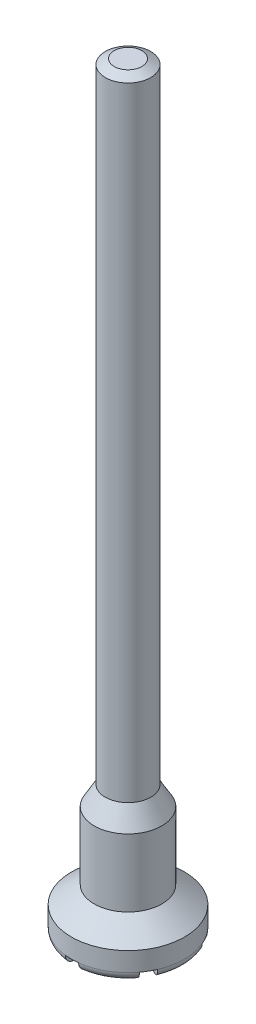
ISO-10303-21;
HEADER;
FILE_DESCRIPTION(('STEP AP214'),'2;1');
FILE_NAME('part.step','',(''),(''),'','','');
FILE_SCHEMA(('AUTOMOTIVE_DESIGN { 1 0 10303 214 1 1 1 1 }'));
ENDSEC;
DATA;
#1=APPLICATION_CONTEXT('core data for automotive mechanical design processes');
#2=APPLICATION_PROTOCOL_DEFINITION('international standard','automotive_design',2000,#1);
#3=PRODUCT_CONTEXT('',#1,'mechanical');
#4=PRODUCT('Part','Part','',(#3));
#5=PRODUCT_RELATED_PRODUCT_CATEGORY('part','',(#4));
#6=PRODUCT_DEFINITION_FORMATION('','',#4);
#7=PRODUCT_DEFINITION_CONTEXT('part definition',#1,'design');
#8=PRODUCT_DEFINITION('design','',#6,#7);
#9=PRODUCT_DEFINITION_SHAPE('','',#8);
#10=(LENGTH_UNIT() NAMED_UNIT(*) SI_UNIT(.MILLI.,.METRE.));
#11=(NAMED_UNIT(*) PLANE_ANGLE_UNIT() SI_UNIT($,.RADIAN.));
#12=(NAMED_UNIT(*) SI_UNIT($,.STERADIAN.) SOLID_ANGLE_UNIT());
#13=UNCERTAINTY_MEASURE_WITH_UNIT(LENGTH_MEASURE(1.E-05),#10,'distance_accuracy_value','');
#14=(GEOMETRIC_REPRESENTATION_CONTEXT(3) GLOBAL_UNCERTAINTY_ASSIGNED_CONTEXT((#13)) GLOBAL_UNIT_ASSIGNED_CONTEXT((#10,
#11,#12)) REPRESENTATION_CONTEXT('',''));
#15=CARTESIAN_POINT('',(0.,0.,0.));
#16=DIRECTION('',(0.,0.,1.));
#17=DIRECTION('',(1.,0.,0.));
#18=AXIS2_PLACEMENT_3D('',#15,#16,#17);
#19=CARTESIAN_POINT('',(0.,0.,0.));
#20=DIRECTION('',(0.,-1.,0.));
#21=DIRECTION('',(0.,0.,-1.));
#22=AXIS2_PLACEMENT_3D('',#19,#20,#21);
#23=PLANE('',#22);
#24=CARTESIAN_POINT('',(0.,0.,0.));
#25=DIRECTION('',(0.,1.,0.));
#26=DIRECTION('',(-0.140186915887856,0.,-0.99012505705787));
#27=AXIS2_PLACEMENT_3D('',#24,#25,#26);
#28=CIRCLE('',#27,1.07);
#29=CARTESIAN_POINT('',(-0.150000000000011,0.,-1.05943381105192));
#30=VERTEX_POINT('',#29);
#31=CARTESIAN_POINT('',(-0.842496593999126,0.,-0.659620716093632));
#32=VERTEX_POINT('',#31);
#33=EDGE_CURVE('E651',#30,#32,#28,.T.);
#34=ORIENTED_EDGE('',*,*,#33,.F.);
#35=DIRECTION('',(0.,0.,1.));
#36=VECTOR('',#35,1.);
#37=CARTESIAN_POINT('',(-0.150000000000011,0.,1.37215571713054));
#38=LINE('',#37,#36);
#39=CARTESIAN_POINT('',(-0.150000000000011,0.,-0.259807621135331));
#40=VERTEX_POINT('',#39);
#41=EDGE_CURVE('E653',#30,#40,#38,.T.);
#42=ORIENTED_EDGE('',*,*,#41,.T.);
#43=DIRECTION('',(-0.866025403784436,0.,-0.5));
#44=VECTOR('',#43,1.);
#45=CARTESIAN_POINT('',(-1.11332170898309,0.,-0.81598166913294));
#46=LINE('',#45,#44);
#47=EDGE_CURVE('E655',#40,#32,#46,.T.);
#48=ORIENTED_EDGE('',*,*,#47,.T.);
#49=EDGE_LOOP('',(#34,#42,#48));
#50=FACE_BOUND('',#49,.T.);
#51=ADVANCED_FACE('F16',(#50),#23,.T.);
#52=CARTESIAN_POINT('',(0.,0.,0.));
#53=DIRECTION('',(0.,-1.,0.));
#54=DIRECTION('',(0.,0.,-1.));
#55=AXIS2_PLACEMENT_3D('',#52,#53,#54);
#56=PLANE('',#55);
#57=DIRECTION('',(-0.866025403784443,0.,0.499999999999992));
#58=VECTOR('',#57,1.);
#59=CARTESIAN_POINT('',(1.11332170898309,0.,-0.815981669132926));
#60=LINE('',#59,#58);
#61=CARTESIAN_POINT('',(-0.299999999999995,0.,0.));
#62=VERTEX_POINT('',#61);
#63=CARTESIAN_POINT('',(-0.992496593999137,0.,0.399813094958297));
#64=VERTEX_POINT('',#63);
#65=EDGE_CURVE('E770',#62,#64,#60,.T.);
#66=ORIENTED_EDGE('',*,*,#65,.T.);
#67=CARTESIAN_POINT('',(0.,0.,0.));
#68=DIRECTION('',(0.,1.,0.));
#69=DIRECTION('',(-0.927566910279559,0.,-0.373657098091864));
#70=AXIS2_PLACEMENT_3D('',#67,#68,#69);
#71=CIRCLE('',#70,1.07);
#72=CARTESIAN_POINT('',(-0.992496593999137,0.,-0.399813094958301));
#73=VERTEX_POINT('',#72);
#74=EDGE_CURVE('E681',#73,#64,#71,.T.);
#75=ORIENTED_EDGE('',*,*,#74,.F.);
#76=DIRECTION('',(0.866025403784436,0.,0.5));
#77=VECTOR('',#76,1.);
#78=CARTESIAN_POINT('',(-1.26332170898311,0.,-0.556174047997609));
#79=LINE('',#78,#77);
#80=EDGE_CURVE('E768',#73,#62,#79,.T.);
#81=ORIENTED_EDGE('',*,*,#80,.T.);
#82=EDGE_LOOP('',(#66,#75,#81));
#83=FACE_BOUND('',#82,.T.);
#84=ADVANCED_FACE('F632',(#83),#56,.T.);
#85=CARTESIAN_POINT('',(0.,0.,0.));
#86=DIRECTION('',(0.,-1.,0.));
#87=DIRECTION('',(0.,0.,-1.));
#88=AXIS2_PLACEMENT_3D('',#85,#86,#87);
#89=PLANE('',#88);
#90=DIRECTION('',(0.,0.,1.));
#91=VECTOR('',#90,1.);
#92=CARTESIAN_POINT('',(-0.150000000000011,0.,1.37215571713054));
#93=LINE('',#92,#91);
#94=CARTESIAN_POINT('',(-0.150000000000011,0.,0.259807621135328));
#95=VERTEX_POINT('',#94);
#96=CARTESIAN_POINT('',(-0.149999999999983,0.,1.05943381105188));
#97=VERTEX_POINT('',#96);
#98=EDGE_CURVE('E155',#95,#97,#93,.T.);
#99=ORIENTED_EDGE('',*,*,#98,.T.);
#100=CARTESIAN_POINT('',(0.,0.,0.));
#101=DIRECTION('',(0.,1.,0.));
#102=DIRECTION('',(-0.787379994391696,0.,0.616467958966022));
#103=AXIS2_PLACEMENT_3D('',#100,#101,#102);
#104=CIRCLE('',#103,1.06999999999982);
#105=CARTESIAN_POINT('',(-0.842496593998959,0.,0.659620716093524));
#106=VERTEX_POINT('',#105);
#107=EDGE_CURVE('E159',#106,#97,#104,.T.);
#108=ORIENTED_EDGE('',*,*,#107,.F.);
#109=DIRECTION('',(0.866025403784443,0.,-0.499999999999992));
#110=VECTOR('',#109,1.);
#111=CARTESIAN_POINT('',(1.26332170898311,0.,-0.556174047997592));
#112=LINE('',#111,#110);
#113=EDGE_CURVE('E162',#106,#95,#112,.T.);
#114=ORIENTED_EDGE('',*,*,#113,.T.);
#115=EDGE_LOOP('',(#99,#108,#114));
#116=FACE_BOUND('',#115,.T.);
#117=ADVANCED_FACE('F157',(#116),#89,.T.);
#118=CARTESIAN_POINT('',(0.,0.,0.));
#119=DIRECTION('',(0.,-1.,0.));
#120=DIRECTION('',(0.,0.,-1.));
#121=AXIS2_PLACEMENT_3D('',#118,#119,#120);
#122=PLANE('',#121);
#123=CARTESIAN_POINT('',(0.,0.,0.));
#124=DIRECTION('',(0.,1.,0.));
#125=DIRECTION('',(0.140186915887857,0.,0.99012505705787));
#126=AXIS2_PLACEMENT_3D('',#123,#124,#125);
#127=CIRCLE('',#126,1.07);
#128=CARTESIAN_POINT('',(0.150000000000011,0.,1.05943381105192));
#129=VERTEX_POINT('',#128);
#130=CARTESIAN_POINT('',(0.842496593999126,0.,0.659620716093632));
#131=VERTEX_POINT('',#130);
#132=EDGE_CURVE('E331',#129,#131,#127,.T.);
#133=ORIENTED_EDGE('',*,*,#132,.F.);
#134=DIRECTION('',(0.,0.,-1.));
#135=VECTOR('',#134,1.);
#136=CARTESIAN_POINT('',(0.150000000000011,0.,1.37215571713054));
#137=LINE('',#136,#135);
#138=CARTESIAN_POINT('',(0.150000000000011,0.,0.259807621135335));
#139=VERTEX_POINT('',#138);
#140=EDGE_CURVE('E222',#129,#139,#137,.T.);
#141=ORIENTED_EDGE('',*,*,#140,.T.);
#142=DIRECTION('',(0.866025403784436,0.,0.5));
#143=VECTOR('',#142,1.);
#144=CARTESIAN_POINT('',(-1.26332170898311,0.,-0.556174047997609));
#145=LINE('',#144,#143);
#146=EDGE_CURVE('E837',#139,#131,#145,.T.);
#147=ORIENTED_EDGE('',*,*,#146,.T.);
#148=EDGE_LOOP('',(#133,#141,#147));
#149=FACE_BOUND('',#148,.T.);
#150=ADVANCED_FACE('F617',(#149),#122,.T.);
#151=CARTESIAN_POINT('',(0.,0.,0.));
#152=DIRECTION('',(0.,-1.,0.));
#153=DIRECTION('',(0.,0.,-1.));
#154=AXIS2_PLACEMENT_3D('',#151,#152,#153);
#155=PLANE('',#154);
#156=DIRECTION('',(0.866025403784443,0.,-0.499999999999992));
#157=VECTOR('',#156,1.);
#158=CARTESIAN_POINT('',(1.26332170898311,0.,-0.556174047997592));
#159=LINE('',#158,#157);
#160=CARTESIAN_POINT('',(0.299999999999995,0.,0.));
#161=VERTEX_POINT('',#160);
#162=CARTESIAN_POINT('',(0.992496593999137,0.,-0.399813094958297));
#163=VERTEX_POINT('',#162);
#164=EDGE_CURVE('E849',#161,#163,#159,.T.);
#165=ORIENTED_EDGE('',*,*,#164,.T.);
#166=CARTESIAN_POINT('',(0.,0.,0.));
#167=DIRECTION('',(0.,1.,0.));
#168=DIRECTION('',(0.927566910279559,0.,0.373657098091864));
#169=AXIS2_PLACEMENT_3D('',#166,#167,#168);
#170=CIRCLE('',#169,1.07);
#171=CARTESIAN_POINT('',(0.992496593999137,0.,0.399813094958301));
#172=VERTEX_POINT('',#171);
#173=EDGE_CURVE('E718',#172,#163,#170,.T.);
#174=ORIENTED_EDGE('',*,*,#173,.F.);
#175=DIRECTION('',(-0.866025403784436,0.,-0.5));
#176=VECTOR('',#175,1.);
#177=CARTESIAN_POINT('',(-1.11332170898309,0.,-0.81598166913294));
#178=LINE('',#177,#176);
#179=EDGE_CURVE('E841',#172,#161,#178,.T.);
#180=ORIENTED_EDGE('',*,*,#179,.T.);
#181=EDGE_LOOP('',(#165,#174,#180));
#182=FACE_BOUND('',#181,.T.);
#183=ADVANCED_FACE('F609',(#182),#155,.T.);
#184=CARTESIAN_POINT('',(0.,0.,0.));
#185=DIRECTION('',(0.,-1.,0.));
#186=DIRECTION('',(0.,0.,-1.));
#187=AXIS2_PLACEMENT_3D('',#184,#185,#186);
#188=PLANE('',#187);
#189=DIRECTION('',(0.,0.,-1.));
#190=VECTOR('',#189,1.);
#191=CARTESIAN_POINT('',(0.150000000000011,0.,1.37215571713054));
#192=LINE('',#191,#190);
#193=CARTESIAN_POINT('',(0.150000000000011,0.,-0.259807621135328));
#194=VERTEX_POINT('',#193);
#195=CARTESIAN_POINT('',(0.149999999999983,0.,-1.05943381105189));
#196=VERTEX_POINT('',#195);
#197=EDGE_CURVE('E780',#194,#196,#192,.T.);
#198=ORIENTED_EDGE('',*,*,#197,.T.);
#199=CARTESIAN_POINT('',(0.,0.,0.));
#200=DIRECTION('',(0.,1.,0.));
#201=DIRECTION('',(0.787379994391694,0.,-0.616467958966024));
#202=AXIS2_PLACEMENT_3D('',#199,#200,#201);
#203=CIRCLE('',#202,1.06999999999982);
#204=CARTESIAN_POINT('',(0.842496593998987,0.,-0.659620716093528));
#205=VERTEX_POINT('',#204);
#206=EDGE_CURVE('E283',#205,#196,#203,.T.);
#207=ORIENTED_EDGE('',*,*,#206,.F.);
#208=DIRECTION('',(-0.866025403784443,0.,0.499999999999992));
#209=VECTOR('',#208,1.);
#210=CARTESIAN_POINT('',(1.11332170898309,0.,-0.815981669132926));
#211=LINE('',#210,#209);
#212=EDGE_CURVE('E782',#205,#194,#211,.T.);
#213=ORIENTED_EDGE('',*,*,#212,.T.);
#214=EDGE_LOOP('',(#198,#207,#213));
#215=FACE_BOUND('',#214,.T.);
#216=ADVANCED_FACE('F602',(#215),#188,.T.);
#217=CARTESIAN_POINT('',(-0.150000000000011,0.199999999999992,1.37215571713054));
#218=DIRECTION('',(-1.,0.,0.));
#219=DIRECTION('',(0.,0.,1.));
#220=AXIS2_PLACEMENT_3D('',#217,#218,#219);
#221=PLANE('',#220);
#222=DIRECTION('',(0.,1.,0.));
#223=VECTOR('',#222,1.);
#224=CARTESIAN_POINT('',(-0.150000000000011,0.200000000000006,0.259807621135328));
#225=LINE('',#224,#223);
#226=CARTESIAN_POINT('',(-0.150000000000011,0.200000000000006,0.259807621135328));
#227=VERTEX_POINT('',#226);
#228=EDGE_CURVE('E772',#95,#227,#225,.T.);
#229=ORIENTED_EDGE('',*,*,#228,.T.);
#230=DIRECTION('',(0.,0.,-1.));
#231=VECTOR('',#230,1.);
#232=CARTESIAN_POINT('',(-0.150000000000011,0.200000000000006,-1.44179222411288));
#233=LINE('',#232,#231);
#234=CARTESIAN_POINT('',(-0.150000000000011,0.199999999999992,1.26111062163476));
#235=VERTEX_POINT('',#234);
#236=EDGE_CURVE('E170',#235,#227,#233,.T.);
#237=ORIENTED_EDGE('',*,*,#236,.F.);
#238=CARTESIAN_POINT('',(-0.150000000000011,0.,1.05943381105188));
#239=CARTESIAN_POINT('',(-0.150000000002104,-9.38730632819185E-06,1.0708558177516));
#240=CARTESIAN_POINT('',(-0.150000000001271,0.000958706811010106,1.08227611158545));
#241=CARTESIAN_POINT('',(-0.14999999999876,0.00478560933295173,1.10479022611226));
#242=CARTESIAN_POINT('',(-0.149999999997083,0.00764354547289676,1.1158841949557));
#243=CARTESIAN_POINT('',(-0.149999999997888,0.0151884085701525,1.13744063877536));
#244=CARTESIAN_POINT('',(-0.150000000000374,0.019876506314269,1.14790270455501));
#245=CARTESIAN_POINT('',(-0.149999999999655,0.0309504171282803,1.1678825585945));
#246=CARTESIAN_POINT('',(-0.149999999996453,0.037335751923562,1.17740061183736));
#247=CARTESIAN_POINT('',(-0.149999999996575,0.0515895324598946,1.1951686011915));
#248=CARTESIAN_POINT('',(-0.149999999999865,0.0594498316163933,1.2034250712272));
#249=CARTESIAN_POINT('',(-0.150000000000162,0.076454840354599,1.2184877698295));
#250=CARTESIAN_POINT('',(-0.149999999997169,0.085599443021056,1.22529411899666));
#251=CARTESIAN_POINT('',(-0.149999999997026,0.104836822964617,1.23720872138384));
#252=CARTESIAN_POINT('',(-0.149999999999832,0.114921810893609,1.24232956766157));
#253=CARTESIAN_POINT('',(-0.150000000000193,0.135809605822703,1.25079058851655));
#254=CARTESIAN_POINT('',(-0.149999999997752,0.146611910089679,1.25413199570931));
#255=CARTESIAN_POINT('',(-0.149999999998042,0.164573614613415,1.25805581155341));
#256=CARTESIAN_POINT('',(-0.149999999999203,0.171615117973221,1.25920071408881));
#257=CARTESIAN_POINT('',(-0.150000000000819,0.18577004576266,1.26072795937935));
#258=CARTESIAN_POINT('',(-0.150000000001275,0.192883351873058,1.26111139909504));
#259=CARTESIAN_POINT('',(-0.149999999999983,0.199999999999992,1.26111062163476));
#260=B_SPLINE_CURVE_WITH_KNOTS('',3,(#238,#239,#240,#241,#242,#243,#244,#245,#246,#247,#248,
#249,#250,#251,#252,#253,#254,#255,#256,#257,#258,#259),.UNSPECIFIED.,.F.,.F.,(4,2,2,2,2,2,2,2,
2,2,4),(0.,0.0342227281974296,0.0684296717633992,0.10265853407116,0.1368777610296,
0.170913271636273,0.204945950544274,0.238718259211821,0.272467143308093,0.293831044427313,
0.315164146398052),.UNSPECIFIED.);
#261=EDGE_CURVE('E167',#97,#235,#260,.T.);
#262=ORIENTED_EDGE('',*,*,#261,.F.);
#263=ORIENTED_EDGE('',*,*,#98,.F.);
#264=EDGE_LOOP('',(#229,#237,#262,#263));
#265=FACE_BOUND('',#264,.T.);
#266=ADVANCED_FACE('F168',(#265),#221,.F.);
#267=CARTESIAN_POINT('',(1.26332170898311,0.200000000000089,-0.556174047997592));
#268=DIRECTION('',(0.499999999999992,0.,0.866025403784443));
#269=DIRECTION('',(0.866025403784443,0.,-0.499999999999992));
#270=AXIS2_PLACEMENT_3D('',#267,#268,#269);
#271=PLANE('',#270);
#272=DIRECTION('',(-0.866025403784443,0.,0.499999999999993));
#273=VECTOR('',#272,1.);
#274=CARTESIAN_POINT('',(-0.150000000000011,0.200000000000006,0.259807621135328));
#275=LINE('',#274,#273);
#276=CARTESIAN_POINT('',(-1.01715383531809,0.200000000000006,0.760459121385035));
#277=VERTEX_POINT('',#276);
#278=EDGE_CURVE('E369',#227,#277,#275,.T.);
#279=ORIENTED_EDGE('',*,*,#278,.F.);
#280=ORIENTED_EDGE('',*,*,#228,.F.);
#281=ORIENTED_EDGE('',*,*,#113,.F.);
#282=CARTESIAN_POINT('',(-1.01715383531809,0.200000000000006,0.760459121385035));
#283=CARTESIAN_POINT('',(-1.01716235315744,0.188808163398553,0.760464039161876));
#284=CARTESIAN_POINT('',(-1.01633505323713,0.177619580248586,0.759986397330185));
#285=CARTESIAN_POINT('',(-1.01307207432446,0.155570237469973,0.758102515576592));
#286=CARTESIAN_POINT('',(-1.01063794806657,0.14470917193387,0.756697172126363));
#287=CARTESIAN_POINT('',(-1.00422299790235,0.123608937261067,0.752993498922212));
#288=CARTESIAN_POINT('',(-1.00024152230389,0.113370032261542,0.750694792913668));
#289=CARTESIAN_POINT('',(-0.990851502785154,0.0938077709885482,0.745273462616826));
#290=CARTESIAN_POINT('',(-0.985443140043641,0.0844842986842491,0.742150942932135));
#291=CARTESIAN_POINT('',(-0.973337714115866,0.0669857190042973,0.735161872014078));
#292=CARTESIAN_POINT('',(-0.966637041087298,0.058813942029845,0.731293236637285));
#293=CARTESIAN_POINT('',(-0.952149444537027,0.0438746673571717,0.722928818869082));
#294=CARTESIAN_POINT('',(-0.944362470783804,0.037107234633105,0.718433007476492));
#295=CARTESIAN_POINT('',(-0.927866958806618,0.0251179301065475,0.708909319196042));
#296=CARTESIAN_POINT('',(-0.919152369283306,0.0199071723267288,0.703877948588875));
#297=CARTESIAN_POINT('',(-0.901094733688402,0.0112357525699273,0.693452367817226));
#298=CARTESIAN_POINT('',(-0.891751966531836,0.00777431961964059,0.688058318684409));
#299=CARTESIAN_POINT('',(-0.875716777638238,0.00349249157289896,0.678800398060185));
#300=CARTESIAN_POINT('',(-0.869118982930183,0.0021832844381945,0.67499115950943));
#301=CARTESIAN_POINT('',(-0.855847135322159,0.000437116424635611,0.667328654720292));
#302=CARTESIAN_POINT('',(-0.849173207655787,-1.11362262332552E-06,0.66347546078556));
#303=CARTESIAN_POINT('',(-0.842496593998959,0.,0.659620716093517));
#304=B_SPLINE_CURVE_WITH_KNOTS('',3,(#282,#283,#284,#285,#286,#287,#288,#289,#290,#291,#292,
#293,#294,#295,#296,#297,#298,#299,#300,#301,#302,#303),.UNSPECIFIED.,.F.,.F.,(4,2,2,2,2,2,2,2,
2,2,4),(0.,0.0335300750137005,0.0670277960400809,0.10053964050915,0.134047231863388,
0.167649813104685,0.201253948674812,0.23509256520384,0.268916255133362,0.292059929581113,
0.315169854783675),.UNSPECIFIED.);
#305=EDGE_CURVE('E178',#277,#106,#304,.T.);
#306=ORIENTED_EDGE('',*,*,#305,.F.);
#307=EDGE_LOOP('',(#279,#280,#281,#306));
#308=FACE_BOUND('',#307,.T.);
#309=ADVANCED_FACE('F587',(#308),#271,.F.);
#310=CARTESIAN_POINT('',(1.11332170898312,0.200000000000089,-0.815981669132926));
#311=DIRECTION('',(-0.499999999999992,0.,-0.866025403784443));
#312=DIRECTION('',(-0.866025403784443,0.,0.499999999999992));
#313=AXIS2_PLACEMENT_3D('',#310,#311,#312);
#314=PLANE('',#313);
#315=ORIENTED_EDGE('',*,*,#65,.F.);
#316=DIRECTION('',(0.,1.,0.));
#317=VECTOR('',#316,1.);
#318=CARTESIAN_POINT('',(-0.299999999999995,0.200000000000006,0.));
#319=LINE('',#318,#317);
#320=CARTESIAN_POINT('',(-0.299999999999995,0.200000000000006,0.));
#321=VERTEX_POINT('',#320);
#322=EDGE_CURVE('E774',#62,#321,#319,.T.);
#323=ORIENTED_EDGE('',*,*,#322,.T.);
#324=DIRECTION('',(0.866025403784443,0.,-0.499999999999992));
#325=VECTOR('',#324,1.);
#326=CARTESIAN_POINT('',(-1.1671538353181,0.200000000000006,0.500651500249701));
#327=LINE('',#326,#325);
#328=CARTESIAN_POINT('',(-1.1671538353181,0.200000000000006,0.500651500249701));
#329=VERTEX_POINT('',#328);
#330=EDGE_CURVE('E374',#329,#321,#327,.T.);
#331=ORIENTED_EDGE('',*,*,#330,.F.);
#332=CARTESIAN_POINT('',(-0.992496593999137,0.,0.399813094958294));
#333=CARTESIAN_POINT('',(-1.00238834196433,-9.38730634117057E-06,0.405524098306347));
#334=CARTESIAN_POINT('',(-1.01227860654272,0.0009587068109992,0.411234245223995));
#335=CARTESIAN_POINT('',(-1.03177640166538,0.00478560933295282,0.422491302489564));
#336=CARTESIAN_POINT('',(-1.04138406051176,0.00764354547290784,0.428038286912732));
#337=CARTESIAN_POINT('',(-1.06005248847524,0.0151884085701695,0.438816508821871));
#338=CARTESIAN_POINT('',(-1.06911290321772,0.0198765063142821,0.444047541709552));
#339=CARTESIAN_POINT('',(-1.08641596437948,0.0309504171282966,0.454037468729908));
#340=CARTESIAN_POINT('',(-1.09465884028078,0.0373357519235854,0.45879649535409));
#341=CARTESIAN_POINT('',(-1.11004637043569,0.0515895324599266,0.467680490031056));
#342=CARTESIAN_POINT('',(-1.11719668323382,0.0594498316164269,0.47180872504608));
#343=CARTESIAN_POINT('',(-1.13024136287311,0.0764548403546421,0.479340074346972));
#344=CARTESIAN_POINT('',(-1.13613583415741,0.0855994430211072,0.48274324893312));
#345=CARTESIAN_POINT('',(-1.14645418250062,0.104836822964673,0.488700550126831));
#346=CARTESIAN_POINT('',(-1.1508889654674,0.114921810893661,0.491260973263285));
#347=CARTESIAN_POINT('',(-1.15821642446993,0.135809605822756,0.495491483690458));
#348=CARTESIAN_POINT('',(-1.16111016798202,0.146611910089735,0.49716218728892));
#349=CARTESIAN_POINT('',(-1.16450829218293,0.164573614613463,0.499124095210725));
#350=CARTESIAN_POINT('',(-1.16549980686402,0.171615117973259,0.499696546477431));
#351=CARTESIAN_POINT('',(-1.16682244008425,0.185770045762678,0.500460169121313));
#352=CARTESIAN_POINT('',(-1.16715450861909,0.192883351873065,0.500651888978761));
#353=CARTESIAN_POINT('',(-1.1671538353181,0.199999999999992,0.500651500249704));
#354=B_SPLINE_CURVE_WITH_KNOTS('',3,(#332,#333,#334,#335,#336,#337,#338,#339,#340,#341,#342,
#343,#344,#345,#346,#347,#348,#349,#350,#351,#352,#353),.UNSPECIFIED.,.F.,.F.,(4,2,2,2,2,2,2,2,
2,2,4),(0.,0.0342227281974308,0.0684296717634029,0.102658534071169,0.136877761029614,
0.170913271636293,0.204945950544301,0.238718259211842,0.272467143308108,0.293831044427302,
0.315164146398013),.UNSPECIFIED.);
#355=EDGE_CURVE('E678',#64,#329,#354,.T.);
#356=ORIENTED_EDGE('',*,*,#355,.F.);
#357=EDGE_LOOP('',(#315,#323,#331,#356));
#358=FACE_BOUND('',#357,.T.);
#359=ADVANCED_FACE('F579',(#358),#314,.F.);
#360=CARTESIAN_POINT('',(-1.26332170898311,0.200000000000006,-0.556174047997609));
#361=DIRECTION('',(-0.500000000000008,0.,0.866025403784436));
#362=DIRECTION('',(0.866025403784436,0.,0.5));
#363=AXIS2_PLACEMENT_3D('',#360,#361,#362);
#364=PLANE('',#363);
#365=DIRECTION('',(-0.866025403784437,0.,-0.5));
#366=VECTOR('',#365,1.);
#367=CARTESIAN_POINT('',(-0.299999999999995,0.200000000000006,0.));
#368=LINE('',#367,#366);
#369=CARTESIAN_POINT('',(-1.16715383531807,0.200000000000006,-0.500651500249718));
#370=VERTEX_POINT('',#369);
#371=EDGE_CURVE('E379',#321,#370,#368,.T.);
#372=ORIENTED_EDGE('',*,*,#371,.F.);
#373=ORIENTED_EDGE('',*,*,#322,.F.);
#374=ORIENTED_EDGE('',*,*,#80,.F.);
#375=CARTESIAN_POINT('',(-1.16715383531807,0.200000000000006,-0.500651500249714));
#376=CARTESIAN_POINT('',(-1.16716235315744,0.18880816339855,-0.500656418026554));
#377=CARTESIAN_POINT('',(-1.16633505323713,0.177619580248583,-0.500178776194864));
#378=CARTESIAN_POINT('',(-1.16307207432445,0.155570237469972,-0.498294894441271));
#379=CARTESIAN_POINT('',(-1.16063794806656,0.144709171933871,-0.496889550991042));
#380=CARTESIAN_POINT('',(-1.15422299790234,0.123608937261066,-0.49318587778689));
#381=CARTESIAN_POINT('',(-1.15024152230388,0.113370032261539,-0.490887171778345));
#382=CARTESIAN_POINT('',(-1.14085150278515,0.0938077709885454,-0.485465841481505));
#383=CARTESIAN_POINT('',(-1.13544314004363,0.0844842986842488,-0.482343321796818));
#384=CARTESIAN_POINT('',(-1.12333771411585,0.0669857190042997,-0.475354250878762));
#385=CARTESIAN_POINT('',(-1.11663704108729,0.0588139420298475,-0.471485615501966));
#386=CARTESIAN_POINT('',(-1.10214944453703,0.0438746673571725,-0.46312119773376));
#387=CARTESIAN_POINT('',(-1.09436247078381,0.0371072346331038,-0.458625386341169));
#388=CARTESIAN_POINT('',(-1.07786695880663,0.0251179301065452,-0.44910169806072));
#389=CARTESIAN_POINT('',(-1.06915236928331,0.0199071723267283,-0.444070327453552));
#390=CARTESIAN_POINT('',(-1.05109473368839,0.0112357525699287,-0.433644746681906));
#391=CARTESIAN_POINT('',(-1.04175196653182,0.00777431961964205,-0.428250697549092));
#392=CARTESIAN_POINT('',(-1.02571677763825,0.00349249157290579,-0.418992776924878));
#393=CARTESIAN_POINT('',(-1.01911898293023,0.00218328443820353,-0.415183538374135));
#394=CARTESIAN_POINT('',(-1.00584713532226,0.000437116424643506,-0.407521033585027));
#395=CARTESIAN_POINT('',(-0.999173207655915,-1.11362261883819E-06,-0.403667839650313));
#396=CARTESIAN_POINT('',(-0.992496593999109,0.,-0.399813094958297));
#397=B_SPLINE_CURVE_WITH_KNOTS('',3,(#375,#376,#377,#378,#379,#380,#381,#382,#383,#384,#385,
#386,#387,#388,#389,#390,#391,#392,#393,#394,#395,#396),.UNSPECIFIED.,.F.,.F.,(4,2,2,2,2,2,2,2,
2,2,4),(0.,0.0335300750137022,0.0670277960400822,0.100539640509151,0.134047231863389,
0.16764981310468,0.201253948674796,0.235092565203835,0.268916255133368,0.292059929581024,
0.315169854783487),.UNSPECIFIED.);
#398=EDGE_CURVE('E658',#370,#73,#397,.T.);
#399=ORIENTED_EDGE('',*,*,#398,.F.);
#400=EDGE_LOOP('',(#372,#373,#374,#399));
#401=FACE_BOUND('',#400,.T.);
#402=ADVANCED_FACE('F572',(#401),#364,.F.);
#403=CARTESIAN_POINT('',(-1.11332170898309,0.200000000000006,-0.81598166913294));
#404=DIRECTION('',(0.500000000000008,0.,-0.866025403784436));
#405=DIRECTION('',(-0.866025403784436,0.,-0.5));
#406=AXIS2_PLACEMENT_3D('',#403,#404,#405);
#407=PLANE('',#406);
#408=ORIENTED_EDGE('',*,*,#47,.F.);
#409=DIRECTION('',(0.,1.,0.));
#410=VECTOR('',#409,1.);
#411=CARTESIAN_POINT('',(-0.150000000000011,0.200000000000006,-0.259807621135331));
#412=LINE('',#411,#410);
#413=CARTESIAN_POINT('',(-0.150000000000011,0.200000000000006,-0.259807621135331));
#414=VERTEX_POINT('',#413);
#415=EDGE_CURVE('E779',#40,#414,#412,.T.);
#416=ORIENTED_EDGE('',*,*,#415,.T.);
#417=DIRECTION('',(0.866025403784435,0.,0.500000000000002));
#418=VECTOR('',#417,1.);
#419=CARTESIAN_POINT('',(-1.01715383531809,0.200000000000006,-0.760459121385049));
#420=LINE('',#419,#418);
#421=CARTESIAN_POINT('',(-1.01715383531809,0.200000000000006,-0.760459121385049));
#422=VERTEX_POINT('',#421);
#423=EDGE_CURVE('E384',#422,#414,#420,.T.);
#424=ORIENTED_EDGE('',*,*,#423,.F.);
#425=CARTESIAN_POINT('',(-0.842496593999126,0.,-0.659620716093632));
#426=CARTESIAN_POINT('',(-0.852388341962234,-9.38730633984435E-06,-0.665331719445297));
#427=CARTESIAN_POINT('',(-0.862278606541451,0.000958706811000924,-0.671041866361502));
#428=CARTESIAN_POINT('',(-0.881776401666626,0.00478560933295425,-0.68229892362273));
#429=CARTESIAN_POINT('',(-0.891384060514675,0.00764354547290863,-0.687845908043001));
#430=CARTESIAN_POINT('',(-0.910052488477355,0.0151884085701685,-0.698624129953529));
#431=CARTESIAN_POINT('',(-0.919112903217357,0.0198765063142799,-0.703855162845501));
#432=CARTESIAN_POINT('',(-0.936415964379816,0.0309504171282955,-0.713845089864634));
#433=CARTESIAN_POINT('',(-0.944658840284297,0.0373357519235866,-0.718604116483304));
#434=CARTESIAN_POINT('',(-0.960046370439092,0.0515895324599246,-0.727488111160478));
#435=CARTESIAN_POINT('',(-0.967196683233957,0.0594498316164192,-0.731616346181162));
#436=CARTESIAN_POINT('',(-0.980241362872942,0.0764548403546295,-0.739147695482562));
#437=CARTESIAN_POINT('',(-0.986135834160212,0.0855994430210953,-0.742550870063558));
#438=CARTESIAN_POINT('',(-0.996454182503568,0.104836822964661,-0.748508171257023));
#439=CARTESIAN_POINT('',(-1.00088896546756,0.114921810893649,-0.751068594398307));
#440=CARTESIAN_POINT('',(-1.00821642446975,0.135809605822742,-0.755299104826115));
#441=CARTESIAN_POINT('',(-1.01111016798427,0.14661191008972,-0.756969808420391));
#442=CARTESIAN_POINT('',(-1.01450829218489,0.164573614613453,-0.758931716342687));
#443=CARTESIAN_POINT('',(-1.01549980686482,0.171615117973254,-0.759504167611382));
#444=CARTESIAN_POINT('',(-1.01682244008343,0.185770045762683,-0.760267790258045));
#445=CARTESIAN_POINT('',(-1.01715450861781,0.192883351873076,-0.760459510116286));
#446=CARTESIAN_POINT('',(-1.01715383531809,0.200000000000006,-0.760459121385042));
#447=B_SPLINE_CURVE_WITH_KNOTS('',3,(#425,#426,#427,#428,#429,#430,#431,#432,#433,#434,#435,
#436,#437,#438,#439,#440,#441,#442,#443,#444,#445,#446),.UNSPECIFIED.,.F.,.F.,(4,2,2,2,2,2,2,2,
2,2,4),(0.,0.03422272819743,0.0684296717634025,0.102658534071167,0.13687776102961,
0.170913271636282,0.204945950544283,0.23871825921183,0.2724671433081,0.293831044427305,
0.315164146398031),.UNSPECIFIED.);
#448=EDGE_CURVE('E661',#32,#422,#447,.T.);
#449=ORIENTED_EDGE('',*,*,#448,.F.);
#450=EDGE_LOOP('',(#408,#416,#424,#449));
#451=FACE_BOUND('',#450,.T.);
#452=ADVANCED_FACE('F566',(#451),#407,.F.);
#453=CARTESIAN_POINT('',(-0.150000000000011,0.199999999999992,1.37215571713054));
#454=DIRECTION('',(-1.,0.,0.));
#455=DIRECTION('',(0.,0.,1.));
#456=AXIS2_PLACEMENT_3D('',#453,#454,#455);
#457=PLANE('',#456);
#458=ORIENTED_EDGE('',*,*,#415,.F.);
#459=ORIENTED_EDGE('',*,*,#41,.F.);
#460=CARTESIAN_POINT('',(-0.150000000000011,0.200000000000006,-1.26111062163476));
#461=CARTESIAN_POINT('',(-0.15000000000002,0.188808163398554,-1.26112045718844));
#462=CARTESIAN_POINT('',(-0.15000000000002,0.177619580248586,-1.26016517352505));
#463=CARTESIAN_POINT('',(-0.150000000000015,0.155570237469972,-1.25639741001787));
#464=CARTESIAN_POINT('',(-0.15000000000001,0.144709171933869,-1.25358672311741));
#465=CARTESIAN_POINT('',(-0.150000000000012,0.123608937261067,-1.2461793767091));
#466=CARTESIAN_POINT('',(-0.150000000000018,0.113370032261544,-1.24158196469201));
#467=CARTESIAN_POINT('',(-0.150000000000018,0.0938077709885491,-1.23073930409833));
#468=CARTESIAN_POINT('',(-0.150000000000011,0.0844842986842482,-1.22449426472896));
#469=CARTESIAN_POINT('',(-0.150000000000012,0.0669857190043,-1.21051612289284));
#470=CARTESIAN_POINT('',(-0.150000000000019,0.0588139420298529,-1.20277885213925));
#471=CARTESIAN_POINT('',(-0.150000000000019,0.0438746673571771,-1.18605001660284));
#472=CARTESIAN_POINT('',(-0.150000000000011,0.0371072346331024,-1.17705839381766));
#473=CARTESIAN_POINT('',(-0.150000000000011,0.0251179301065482,-1.15801101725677));
#474=CARTESIAN_POINT('',(-0.15000000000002,0.0199071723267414,-1.14794827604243));
#475=CARTESIAN_POINT('',(-0.150000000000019,0.011235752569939,-1.12709711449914));
#476=CARTESIAN_POINT('',(-0.15000000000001,0.00777431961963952,-1.1163090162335));
#477=CARTESIAN_POINT('',(-0.150000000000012,0.00349249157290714,-1.09779317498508));
#478=CARTESIAN_POINT('',(-0.150000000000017,0.00218328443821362,-1.09017469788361));
#479=CARTESIAN_POINT('',(-0.150000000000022,0.000437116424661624,-1.0748496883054));
#480=CARTESIAN_POINT('',(-0.150000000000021,-1.1136226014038E-06,-1.06714330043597));
#481=CARTESIAN_POINT('',(-0.150000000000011,0.,-1.05943381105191));
#482=B_SPLINE_CURVE_WITH_KNOTS('',3,(#460,#461,#462,#463,#464,#465,#466,#467,#468,#469,#470,
#471,#472,#473,#474,#475,#476,#477,#478,#479,#480,#481),.UNSPECIFIED.,.F.,.F.,(4,2,2,2,2,2,2,2,
2,2,4),(0.,0.0335300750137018,0.0670277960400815,0.100539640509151,0.134047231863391,
0.167649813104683,0.201253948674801,0.235092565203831,0.268916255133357,0.292059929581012,
0.315169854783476),.UNSPECIFIED.);
#483=CARTESIAN_POINT('',(-0.150000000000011,0.200000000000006,-1.26111062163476));
#484=VERTEX_POINT('',#483);
#485=EDGE_CURVE('E78',#484,#30,#482,.T.);
#486=ORIENTED_EDGE('',*,*,#485,.F.);
#487=DIRECTION('',(0.,0.,-1.));
#488=VECTOR('',#487,1.);
#489=CARTESIAN_POINT('',(-0.150000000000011,0.200000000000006,-1.44179222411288));
#490=LINE('',#489,#488);
#491=EDGE_CURVE('E389',#414,#484,#490,.T.);
#492=ORIENTED_EDGE('',*,*,#491,.F.);
#493=EDGE_LOOP('',(#458,#459,#486,#492));
#494=FACE_BOUND('',#493,.T.);
#495=ADVANCED_FACE('F560',(#494),#457,.F.);
#496=CARTESIAN_POINT('',(0.150000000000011,0.199999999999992,1.37215571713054));
#497=DIRECTION('',(1.,0.,0.));
#498=DIRECTION('',(0.,0.,-1.));
#499=AXIS2_PLACEMENT_3D('',#496,#497,#498);
#500=PLANE('',#499);
#501=DIRECTION('',(0.,1.,0.));
#502=VECTOR('',#501,1.);
#503=CARTESIAN_POINT('',(0.150000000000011,0.200000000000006,-0.259807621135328));
#504=LINE('',#503,#502);
#505=CARTESIAN_POINT('',(0.150000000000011,0.200000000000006,-0.259807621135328));
#506=VERTEX_POINT('',#505);
#507=EDGE_CURVE('E855',#194,#506,#504,.T.);
#508=ORIENTED_EDGE('',*,*,#507,.T.);
#509=DIRECTION('',(0.,0.,-1.));
#510=VECTOR('',#509,1.);
#511=CARTESIAN_POINT('',(0.150000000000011,0.200000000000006,-1.44179222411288));
#512=LINE('',#511,#510);
#513=CARTESIAN_POINT('',(0.150000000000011,0.200000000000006,-1.26111062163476));
#514=VERTEX_POINT('',#513);
#515=EDGE_CURVE('E40',#514,#506,#512,.F.);
#516=ORIENTED_EDGE('',*,*,#515,.F.);
#517=CARTESIAN_POINT('',(0.150000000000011,0.,-1.05943381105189));
#518=CARTESIAN_POINT('',(0.150000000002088,-9.38730632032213E-06,-1.0708558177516));
#519=CARTESIAN_POINT('',(0.150000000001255,0.000958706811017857,-1.08227611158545));
#520=CARTESIAN_POINT('',(0.149999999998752,0.00478560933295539,-1.10479022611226));
#521=CARTESIAN_POINT('',(0.149999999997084,0.00764354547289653,-1.1158841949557));
#522=CARTESIAN_POINT('',(0.149999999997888,0.0151884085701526,-1.13744063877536));
#523=CARTESIAN_POINT('',(0.150000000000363,0.0198765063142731,-1.14790270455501));
#524=CARTESIAN_POINT('',(0.149999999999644,0.030950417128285,-1.1678825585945));
#525=CARTESIAN_POINT('',(0.149999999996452,0.0373357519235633,-1.17740061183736));
#526=CARTESIAN_POINT('',(0.149999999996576,0.0515895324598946,-1.1951686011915));
#527=CARTESIAN_POINT('',(0.149999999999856,0.0594498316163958,-1.2034250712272));
#528=CARTESIAN_POINT('',(0.150000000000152,0.0764548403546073,-1.2184877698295));
#529=CARTESIAN_POINT('',(0.149999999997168,0.0855994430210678,-1.22529411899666));
#530=CARTESIAN_POINT('',(0.149999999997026,0.104836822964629,-1.23720872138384));
#531=CARTESIAN_POINT('',(0.149999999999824,0.114921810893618,-1.24232956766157));
#532=CARTESIAN_POINT('',(0.150000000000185,0.135809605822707,-1.25079058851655));
#533=CARTESIAN_POINT('',(0.149999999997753,0.146611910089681,-1.25413199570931));
#534=CARTESIAN_POINT('',(0.149999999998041,0.164573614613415,-1.25805581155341));
#535=CARTESIAN_POINT('',(0.149999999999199,0.171615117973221,-1.25920071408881));
#536=CARTESIAN_POINT('',(0.150000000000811,0.18577004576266,-1.26072795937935));
#537=CARTESIAN_POINT('',(0.150000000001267,0.192883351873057,-1.26111139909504));
#538=CARTESIAN_POINT('',(0.149999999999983,0.199999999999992,-1.26111062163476));
#539=B_SPLINE_CURVE_WITH_KNOTS('',3,(#517,#518,#519,#520,#521,#522,#523,#524,#525,#526,#527,
#528,#529,#530,#531,#532,#533,#534,#535,#536,#537,#538),.UNSPECIFIED.,.F.,.F.,(4,2,2,2,2,2,2,2,
2,2,4),(0.,0.0342227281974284,0.0684296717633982,0.102658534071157,0.136877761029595,
0.170913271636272,0.20494595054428,0.238718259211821,0.272467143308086,0.293831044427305,
0.315164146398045),.UNSPECIFIED.);
#540=EDGE_CURVE('E281',#196,#514,#539,.T.);
#541=ORIENTED_EDGE('',*,*,#540,.F.);
#542=ORIENTED_EDGE('',*,*,#197,.F.);
#543=EDGE_LOOP('',(#508,#516,#541,#542));
#544=FACE_BOUND('',#543,.T.);
#545=ADVANCED_FACE('F293',(#544),#500,.F.);
#546=CARTESIAN_POINT('',(1.11332170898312,0.200000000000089,-0.815981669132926));
#547=DIRECTION('',(-0.499999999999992,0.,-0.866025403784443));
#548=DIRECTION('',(-0.866025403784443,0.,0.499999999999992));
#549=AXIS2_PLACEMENT_3D('',#546,#547,#548);
#550=PLANE('',#549);
#551=DIRECTION('',(0.866025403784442,0.,-0.499999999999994));
#552=VECTOR('',#551,1.);
#553=CARTESIAN_POINT('',(0.150000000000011,0.200000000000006,-0.259807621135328));
#554=LINE('',#553,#552);
#555=CARTESIAN_POINT('',(1.01715383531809,0.200000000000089,-0.760459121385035));
#556=VERTEX_POINT('',#555);
#557=EDGE_CURVE('E358',#506,#556,#554,.T.);
#558=ORIENTED_EDGE('',*,*,#557,.F.);
#559=ORIENTED_EDGE('',*,*,#507,.F.);
#560=ORIENTED_EDGE('',*,*,#212,.F.);
#561=CARTESIAN_POINT('',(1.01715383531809,0.200000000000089,-0.760459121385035));
#562=CARTESIAN_POINT('',(1.01716235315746,0.18880816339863,-0.760464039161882));
#563=CARTESIAN_POINT('',(1.01633505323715,0.177619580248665,-0.759986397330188));
#564=CARTESIAN_POINT('',(1.01307207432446,0.155570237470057,-0.75810251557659));
#565=CARTESIAN_POINT('',(1.01063794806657,0.144709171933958,-0.756697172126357));
#566=CARTESIAN_POINT('',(1.00422299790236,0.123608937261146,-0.752993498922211));
#567=CARTESIAN_POINT('',(1.00024152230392,0.11337003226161,-0.750694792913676));
#568=CARTESIAN_POINT('',(0.990851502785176,0.0938077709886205,-0.745273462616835));
#569=CARTESIAN_POINT('',(0.985443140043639,0.0844842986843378,-0.742150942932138));
#570=CARTESIAN_POINT('',(0.973337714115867,0.0669857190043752,-0.735161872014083));
#571=CARTESIAN_POINT('',(0.966637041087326,0.0588139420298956,-0.731293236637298));
#572=CARTESIAN_POINT('',(0.952149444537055,0.0438746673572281,-0.722928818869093));
#573=CARTESIAN_POINT('',(0.944362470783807,0.0371072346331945,-0.718433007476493));
#574=CARTESIAN_POINT('',(0.927866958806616,0.025117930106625,-0.708909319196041));
#575=CARTESIAN_POINT('',(0.919152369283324,0.0199071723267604,-0.703877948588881));
#576=CARTESIAN_POINT('',(0.901094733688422,0.011235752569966,-0.693452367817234));
#577=CARTESIAN_POINT('',(0.891751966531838,0.00777431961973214,-0.688058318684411));
#578=CARTESIAN_POINT('',(0.875716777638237,0.0034924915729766,-0.678800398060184));
#579=CARTESIAN_POINT('',(0.869118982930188,0.00218328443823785,-0.67499115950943));
#580=CARTESIAN_POINT('',(0.855847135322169,0.000437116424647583,-0.667328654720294));
#581=CARTESIAN_POINT('',(0.849173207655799,-1.11362260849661E-06,-0.663475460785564));
#582=CARTESIAN_POINT('',(0.842496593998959,0.,-0.659620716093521));
#583=B_SPLINE_CURVE_WITH_KNOTS('',3,(#561,#562,#563,#564,#565,#566,#567,#568,#569,#570,#571,
#572,#573,#574,#575,#576,#577,#578,#579,#580,#581,#582),.UNSPECIFIED.,.F.,.F.,(4,2,2,2,2,2,2,2,
2,2,4),(0.,0.0335300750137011,0.067027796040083,0.100539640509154,0.134047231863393,
0.167649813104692,0.201253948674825,0.235092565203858,0.268916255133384,0.292059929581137,
0.315169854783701),.UNSPECIFIED.);
#584=EDGE_CURVE('E291',#556,#205,#583,.T.);
#585=ORIENTED_EDGE('',*,*,#584,.F.);
#586=EDGE_LOOP('',(#558,#559,#560,#585));
#587=FACE_BOUND('',#586,.T.);
#588=ADVANCED_FACE('F547',(#587),#550,.F.);
#589=CARTESIAN_POINT('',(1.26332170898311,0.200000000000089,-0.556174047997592));
#590=DIRECTION('',(0.499999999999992,0.,0.866025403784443));
#591=DIRECTION('',(0.866025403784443,0.,-0.499999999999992));
#592=AXIS2_PLACEMENT_3D('',#589,#590,#591);
#593=PLANE('',#592);
#594=ORIENTED_EDGE('',*,*,#164,.F.);
#595=DIRECTION('',(0.,1.,0.));
#596=VECTOR('',#595,1.);
#597=CARTESIAN_POINT('',(0.299999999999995,0.200000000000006,0.));
#598=LINE('',#597,#596);
#599=CARTESIAN_POINT('',(0.299999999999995,0.200000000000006,0.));
#600=VERTEX_POINT('',#599);
#601=EDGE_CURVE('E839',#161,#600,#598,.T.);
#602=ORIENTED_EDGE('',*,*,#601,.T.);
#603=DIRECTION('',(-0.866025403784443,0.,0.499999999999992));
#604=VECTOR('',#603,1.);
#605=CARTESIAN_POINT('',(1.1671538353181,0.200000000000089,-0.500651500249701));
#606=LINE('',#605,#604);
#607=CARTESIAN_POINT('',(1.1671538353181,0.200000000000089,-0.500651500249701));
#608=VERTEX_POINT('',#607);
#609=EDGE_CURVE('E344',#608,#600,#606,.T.);
#610=ORIENTED_EDGE('',*,*,#609,.F.);
#611=CARTESIAN_POINT('',(0.992496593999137,0.,-0.399813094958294));
#612=CARTESIAN_POINT('',(1.00238834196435,-9.38730632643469E-06,-0.40552409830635));
#613=CARTESIAN_POINT('',(1.01227860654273,0.000958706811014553,-0.411234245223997));
#614=CARTESIAN_POINT('',(1.03177640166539,0.00478560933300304,-0.422491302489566));
#615=CARTESIAN_POINT('',(1.04138406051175,0.00764354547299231,-0.428038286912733));
#616=CARTESIAN_POINT('',(1.06005248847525,0.0151884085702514,-0.438816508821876));
#617=CARTESIAN_POINT('',(1.06911290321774,0.0198765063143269,-0.444047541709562));
#618=CARTESIAN_POINT('',(1.0864159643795,0.0309504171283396,-0.454037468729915));
#619=CARTESIAN_POINT('',(1.09465884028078,0.0373357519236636,-0.458796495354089));
#620=CARTESIAN_POINT('',(1.1100463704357,0.0515895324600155,-0.467680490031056));
#621=CARTESIAN_POINT('',(1.11719668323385,0.0594498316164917,-0.471808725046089));
#622=CARTESIAN_POINT('',(1.13024136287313,0.076454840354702,-0.479340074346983));
#623=CARTESIAN_POINT('',(1.13613583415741,0.085599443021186,-0.482743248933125));
#624=CARTESIAN_POINT('',(1.14645418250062,0.10483682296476,-0.488700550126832));
#625=CARTESIAN_POINT('',(1.15088896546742,0.114921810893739,-0.49126097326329));
#626=CARTESIAN_POINT('',(1.15821642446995,0.13580960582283,-0.495491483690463));
#627=CARTESIAN_POINT('',(1.16111016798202,0.146611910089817,-0.497162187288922));
#628=CARTESIAN_POINT('',(1.16450829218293,0.164573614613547,-0.499124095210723));
#629=CARTESIAN_POINT('',(1.16549980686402,0.171615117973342,-0.499696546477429));
#630=CARTESIAN_POINT('',(1.16682244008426,0.18577004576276,-0.500460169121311));
#631=CARTESIAN_POINT('',(1.1671545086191,0.192883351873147,-0.500651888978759));
#632=CARTESIAN_POINT('',(1.1671538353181,0.200000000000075,-0.500651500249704));
#633=B_SPLINE_CURVE_WITH_KNOTS('',3,(#611,#612,#613,#614,#615,#616,#617,#618,#619,#620,#621,
#622,#623,#624,#625,#626,#627,#628,#629,#630,#631,#632),.UNSPECIFIED.,.F.,.F.,(4,2,2,2,2,2,2,2,
2,2,4),(0.,0.0342227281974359,0.0684296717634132,0.102658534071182,0.136877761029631,
0.170913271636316,0.204945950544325,0.238718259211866,0.272467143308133,0.293831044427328,
0.315164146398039),.UNSPECIFIED.);
#634=EDGE_CURVE('E354',#163,#608,#633,.T.);
#635=ORIENTED_EDGE('',*,*,#634,.F.);
#636=EDGE_LOOP('',(#594,#602,#610,#635));
#637=FACE_BOUND('',#636,.T.);
#638=ADVANCED_FACE('F540',(#637),#593,.F.);
#639=CARTESIAN_POINT('',(-1.11332170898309,0.200000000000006,-0.81598166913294));
#640=DIRECTION('',(0.500000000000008,0.,-0.866025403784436));
#641=DIRECTION('',(-0.866025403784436,0.,-0.5));
#642=AXIS2_PLACEMENT_3D('',#639,#640,#641);
#643=PLANE('',#642);
#644=DIRECTION('',(0.866025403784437,0.,0.5));
#645=VECTOR('',#644,1.);
#646=CARTESIAN_POINT('',(0.299999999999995,0.200000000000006,0.));
#647=LINE('',#646,#645);
#648=CARTESIAN_POINT('',(1.16715383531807,0.200000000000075,0.500651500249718));
#649=VERTEX_POINT('',#648);
#650=EDGE_CURVE('E341',#600,#649,#647,.T.);
#651=ORIENTED_EDGE('',*,*,#650,.F.);
#652=ORIENTED_EDGE('',*,*,#601,.F.);
#653=ORIENTED_EDGE('',*,*,#179,.F.);
#654=CARTESIAN_POINT('',(1.16715383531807,0.200000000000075,0.500651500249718));
#655=CARTESIAN_POINT('',(1.16716235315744,0.188808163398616,0.50065641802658));
#656=CARTESIAN_POINT('',(1.16633505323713,0.177619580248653,0.500178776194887));
#657=CARTESIAN_POINT('',(1.16307207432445,0.155570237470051,0.498294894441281));
#658=CARTESIAN_POINT('',(1.16063794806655,0.144709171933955,0.496889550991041));
#659=CARTESIAN_POINT('',(1.15422299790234,0.123608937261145,0.493185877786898));
#660=CARTESIAN_POINT('',(1.1502415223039,0.113370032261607,0.490887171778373));
#661=CARTESIAN_POINT('',(1.14085150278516,0.0938077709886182,0.485465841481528));
#662=CARTESIAN_POINT('',(1.13544314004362,0.0844842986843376,0.482343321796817));
#663=CARTESIAN_POINT('',(1.12333771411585,0.0669857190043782,0.475354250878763));
#664=CARTESIAN_POINT('',(1.1166370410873,0.0588139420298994,0.471485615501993));
#665=CARTESIAN_POINT('',(1.10214944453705,0.0438746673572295,0.463121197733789));
#666=CARTESIAN_POINT('',(1.09436247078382,0.0371072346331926,0.458625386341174));
#667=CARTESIAN_POINT('',(1.07786695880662,0.0251179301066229,0.449101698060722));
#668=CARTESIAN_POINT('',(1.06915236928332,0.0199071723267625,0.444070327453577));
#669=CARTESIAN_POINT('',(1.0510947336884,0.0112357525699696,0.433644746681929));
#670=CARTESIAN_POINT('',(1.04175196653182,0.00777431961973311,0.428250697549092));
#671=CARTESIAN_POINT('',(1.02571677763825,0.00349249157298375,0.418992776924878));
#672=CARTESIAN_POINT('',(1.01911898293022,0.00218328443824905,0.415183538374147));
#673=CARTESIAN_POINT('',(1.00584713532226,0.000437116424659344,0.407521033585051));
#674=CARTESIAN_POINT('',(0.999173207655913,-1.11362260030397E-06,0.403667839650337));
#675=CARTESIAN_POINT('',(0.992496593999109,0.,0.399813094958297));
#676=B_SPLINE_CURVE_WITH_KNOTS('',3,(#654,#655,#656,#657,#658,#659,#660,#661,#662,#663,#664,
#665,#666,#667,#668,#669,#670,#671,#672,#673,#674,#675),.UNSPECIFIED.,.F.,.F.,(4,2,2,2,2,2,2,2,
2,2,4),(0.,0.0335300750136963,0.0670277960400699,0.100539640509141,0.134047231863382,
0.167649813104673,0.201253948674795,0.235092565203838,0.268916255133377,0.292059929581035,
0.315169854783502),.UNSPECIFIED.);
#677=EDGE_CURVE('E352',#649,#172,#676,.T.);
#678=ORIENTED_EDGE('',*,*,#677,.F.);
#679=EDGE_LOOP('',(#651,#652,#653,#678));
#680=FACE_BOUND('',#679,.T.);
#681=ADVANCED_FACE('F534',(#680),#643,.F.);
#682=CARTESIAN_POINT('',(-1.26332170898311,0.200000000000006,-0.556174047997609));
#683=DIRECTION('',(-0.500000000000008,0.,0.866025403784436));
#684=DIRECTION('',(0.866025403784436,0.,0.5));
#685=AXIS2_PLACEMENT_3D('',#682,#683,#684);
#686=PLANE('',#685);
#687=ORIENTED_EDGE('',*,*,#146,.F.);
#688=DIRECTION('',(0.,1.,0.));
#689=VECTOR('',#688,1.);
#690=CARTESIAN_POINT('',(0.150000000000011,0.200000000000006,0.259807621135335));
#691=LINE('',#690,#689);
#692=CARTESIAN_POINT('',(0.150000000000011,0.200000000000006,0.259807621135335));
#693=VERTEX_POINT('',#692);
#694=EDGE_CURVE('E87',#139,#693,#691,.T.);
#695=ORIENTED_EDGE('',*,*,#694,.T.);
#696=DIRECTION('',(-0.866025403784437,0.,-0.5));
#697=VECTOR('',#696,1.);
#698=CARTESIAN_POINT('',(1.01715383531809,0.200000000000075,0.760459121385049));
#699=LINE('',#698,#697);
#700=CARTESIAN_POINT('',(1.01715383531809,0.200000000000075,0.760459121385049));
#701=VERTEX_POINT('',#700);
#702=EDGE_CURVE('E338',#701,#693,#699,.T.);
#703=ORIENTED_EDGE('',*,*,#702,.F.);
#704=CARTESIAN_POINT('',(0.842496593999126,0.,0.659620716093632));
#705=CARTESIAN_POINT('',(0.852388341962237,-9.3873063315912E-06,0.665331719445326));
#706=CARTESIAN_POINT('',(0.862278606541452,0.000958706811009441,0.67104186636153));
#707=CARTESIAN_POINT('',(0.881776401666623,0.00478560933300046,0.682298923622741));
#708=CARTESIAN_POINT('',(0.891384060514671,0.0076435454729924,0.687845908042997));
#709=CARTESIAN_POINT('',(0.910052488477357,0.0151884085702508,0.698624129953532));
#710=CARTESIAN_POINT('',(0.919112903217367,0.0198765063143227,0.703855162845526));
#711=CARTESIAN_POINT('',(0.936415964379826,0.0309504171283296,0.713845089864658));
#712=CARTESIAN_POINT('',(0.944658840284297,0.0373357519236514,0.718604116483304));
#713=CARTESIAN_POINT('',(0.960046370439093,0.0515895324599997,0.727488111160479));
#714=CARTESIAN_POINT('',(0.967196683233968,0.0594498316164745,0.731616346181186));
#715=CARTESIAN_POINT('',(0.980241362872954,0.0764548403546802,0.739147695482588));
#716=CARTESIAN_POINT('',(0.986135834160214,0.0855994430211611,0.742550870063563));
#717=CARTESIAN_POINT('',(0.996454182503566,0.104836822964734,0.748508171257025));
#718=CARTESIAN_POINT('',(1.00088896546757,0.114921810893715,0.751068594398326));
#719=CARTESIAN_POINT('',(1.00821642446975,0.135809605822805,0.755299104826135));
#720=CARTESIAN_POINT('',(1.01111016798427,0.146611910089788,0.756969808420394));
#721=CARTESIAN_POINT('',(1.01450829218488,0.164573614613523,0.758931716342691));
#722=CARTESIAN_POINT('',(1.01549980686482,0.171615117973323,0.759504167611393));
#723=CARTESIAN_POINT('',(1.01682244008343,0.185770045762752,0.760267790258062));
#724=CARTESIAN_POINT('',(1.01715450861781,0.192883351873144,0.760459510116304));
#725=CARTESIAN_POINT('',(1.01715383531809,0.200000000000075,0.760459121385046));
#726=B_SPLINE_CURVE_WITH_KNOTS('',3,(#704,#705,#706,#707,#708,#709,#710,#711,#712,#713,#714,
#715,#716,#717,#718,#719,#720,#721,#722,#723,#724,#725),.UNSPECIFIED.,.F.,.F.,(4,2,2,2,2,2,2,2,
2,2,4),(0.,0.0342227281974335,0.068429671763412,0.102658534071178,0.13687776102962,
0.170913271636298,0.204945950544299,0.238718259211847,0.272467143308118,0.293831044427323,
0.315164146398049),.UNSPECIFIED.);
#727=EDGE_CURVE('E174',#131,#701,#726,.T.);
#728=ORIENTED_EDGE('',*,*,#727,.F.);
#729=EDGE_LOOP('',(#687,#695,#703,#728));
#730=FACE_BOUND('',#729,.T.);
#731=ADVANCED_FACE('F527',(#730),#686,.F.);
#732=CARTESIAN_POINT('',(0.150000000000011,0.199999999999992,1.37215571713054));
#733=DIRECTION('',(1.,0.,0.));
#734=DIRECTION('',(0.,0.,-1.));
#735=AXIS2_PLACEMENT_3D('',#732,#733,#734);
#736=PLANE('',#735);
#737=ORIENTED_EDGE('',*,*,#694,.F.);
#738=ORIENTED_EDGE('',*,*,#140,.F.);
#739=CARTESIAN_POINT('',(0.150000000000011,0.199999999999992,1.26111062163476));
#740=CARTESIAN_POINT('',(0.15000000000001,0.188808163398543,1.26112045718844));
#741=CARTESIAN_POINT('',(0.15000000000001,0.177619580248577,1.26016517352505));
#742=CARTESIAN_POINT('',(0.150000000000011,0.155570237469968,1.25639741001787));
#743=CARTESIAN_POINT('',(0.150000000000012,0.144709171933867,1.25358672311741));
#744=CARTESIAN_POINT('',(0.150000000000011,0.123608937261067,1.2461793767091));
#745=CARTESIAN_POINT('',(0.150000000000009,0.113370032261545,1.24158196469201));
#746=CARTESIAN_POINT('',(0.15000000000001,0.0938077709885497,1.23073930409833));
#747=CARTESIAN_POINT('',(0.150000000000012,0.0844842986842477,1.22449426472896));
#748=CARTESIAN_POINT('',(0.150000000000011,0.0669857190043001,1.21051612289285));
#749=CARTESIAN_POINT('',(0.150000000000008,0.0588139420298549,1.20277885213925));
#750=CARTESIAN_POINT('',(0.150000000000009,0.043874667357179,1.18605001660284));
#751=CARTESIAN_POINT('',(0.150000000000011,0.0371072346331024,1.17705839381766));
#752=CARTESIAN_POINT('',(0.150000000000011,0.0251179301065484,1.15801101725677));
#753=CARTESIAN_POINT('',(0.150000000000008,0.0199071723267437,1.14794827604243));
#754=CARTESIAN_POINT('',(0.150000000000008,0.0112357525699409,1.12709711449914));
#755=CARTESIAN_POINT('',(0.150000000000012,0.00777431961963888,1.1163090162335));
#756=CARTESIAN_POINT('',(0.150000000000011,0.00349249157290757,1.09779317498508));
#757=CARTESIAN_POINT('',(0.150000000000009,0.00218328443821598,1.09017469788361));
#758=CARTESIAN_POINT('',(0.150000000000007,0.000437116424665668,1.0748496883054));
#759=CARTESIAN_POINT('',(0.150000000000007,-1.11362259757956E-06,1.06714330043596));
#760=CARTESIAN_POINT('',(0.150000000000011,0.,1.05943381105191));
#761=B_SPLINE_CURVE_WITH_KNOTS('',3,(#739,#740,#741,#742,#743,#744,#745,#746,#747,#748,#749,
#750,#751,#752,#753,#754,#755,#756,#757,#758,#759,#760),.UNSPECIFIED.,.F.,.F.,(4,2,2,2,2,2,2,2,
2,2,4),(0.,0.0335300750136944,0.0670277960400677,0.100539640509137,0.134047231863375,
0.167649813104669,0.201253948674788,0.235092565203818,0.268916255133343,0.292059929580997,
0.315169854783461),.UNSPECIFIED.);
#762=CARTESIAN_POINT('',(0.150000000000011,0.199999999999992,1.26111062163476));
#763=VERTEX_POINT('',#762);
#764=EDGE_CURVE('E328',#763,#129,#761,.T.);
#765=ORIENTED_EDGE('',*,*,#764,.F.);
#766=DIRECTION('',(0.,0.,-1.));
#767=VECTOR('',#766,1.);
#768=CARTESIAN_POINT('',(0.150000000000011,0.200000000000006,-1.44179222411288));
#769=LINE('',#768,#767);
#770=EDGE_CURVE('E407',#693,#763,#769,.F.);
#771=ORIENTED_EDGE('',*,*,#770,.F.);
#772=EDGE_LOOP('',(#737,#738,#765,#771));
#773=FACE_BOUND('',#772,.T.);
#774=ADVANCED_FACE('F228',(#773),#736,.F.);
#775=CARTESIAN_POINT('',(0.,0.200000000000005,0.));
#776=DIRECTION('',(0.,-1.,0.));
#777=DIRECTION('',(0.,0.,-1.));
#778=AXIS2_PLACEMENT_3D('',#775,#776,#777);
#779=TOROIDAL_SURFACE('',#778,1.07,0.2);
#780=ORIENTED_EDGE('',*,*,#485,.T.);
#781=ORIENTED_EDGE('',*,*,#33,.T.);
#782=ORIENTED_EDGE('',*,*,#448,.T.);
#783=CARTESIAN_POINT('',(0.,0.200000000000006,0.));
#784=DIRECTION('',(0.,-1.,0.));
#785=DIRECTION('',(0.,0.,-1.));
#786=AXIS2_PLACEMENT_3D('',#783,#784,#785);
#787=CIRCLE('',#786,1.27);
#788=EDGE_CURVE('E280',#484,#422,#787,.F.);
#789=ORIENTED_EDGE('',*,*,#788,.F.);
#790=EDGE_LOOP('',(#780,#781,#782,#789));
#791=FACE_BOUND('',#790,.T.);
#792=ADVANCED_FACE('F224',(#791),#779,.T.);
#793=CARTESIAN_POINT('',(0.,0.200000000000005,0.));
#794=DIRECTION('',(0.,-1.,0.));
#795=DIRECTION('',(0.,0.,-1.));
#796=AXIS2_PLACEMENT_3D('',#793,#794,#795);
#797=TOROIDAL_SURFACE('',#796,1.07,0.2);
#798=ORIENTED_EDGE('',*,*,#355,.T.);
#799=CARTESIAN_POINT('',(0.,0.200000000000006,0.));
#800=DIRECTION('',(0.,-1.,0.));
#801=DIRECTION('',(0.,0.,-1.));
#802=AXIS2_PLACEMENT_3D('',#799,#800,#801);
#803=CIRCLE('',#802,1.27);
#804=EDGE_CURVE('E214',#370,#329,#803,.F.);
#805=ORIENTED_EDGE('',*,*,#804,.F.);
#806=ORIENTED_EDGE('',*,*,#398,.T.);
#807=ORIENTED_EDGE('',*,*,#74,.T.);
#808=EDGE_LOOP('',(#798,#805,#806,#807));
#809=FACE_BOUND('',#808,.T.);
#810=ADVANCED_FACE('F201',(#809),#797,.T.);
#811=CARTESIAN_POINT('',(0.,0.200000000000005,0.));
#812=DIRECTION('',(0.,-1.,0.));
#813=DIRECTION('',(0.,0.,-1.));
#814=AXIS2_PLACEMENT_3D('',#811,#812,#813);
#815=TOROIDAL_SURFACE('',#814,1.07,0.2);
#816=ORIENTED_EDGE('',*,*,#261,.T.);
#817=CARTESIAN_POINT('',(0.,0.200000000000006,0.));
#818=DIRECTION('',(0.,-1.,0.));
#819=DIRECTION('',(0.,0.,-1.));
#820=AXIS2_PLACEMENT_3D('',#817,#818,#819);
#821=CIRCLE('',#820,1.27);
#822=EDGE_CURVE('E213',#277,#235,#821,.F.);
#823=ORIENTED_EDGE('',*,*,#822,.F.);
#824=ORIENTED_EDGE('',*,*,#305,.T.);
#825=ORIENTED_EDGE('',*,*,#107,.T.);
#826=EDGE_LOOP('',(#816,#823,#824,#825));
#827=FACE_BOUND('',#826,.T.);
#828=ADVANCED_FACE('F177',(#827),#815,.T.);
#829=CARTESIAN_POINT('',(0.,0.200000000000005,0.));
#830=DIRECTION('',(0.,-1.,0.));
#831=DIRECTION('',(0.,0.,-1.));
#832=AXIS2_PLACEMENT_3D('',#829,#830,#831);
#833=TOROIDAL_SURFACE('',#832,1.07,0.2);
#834=ORIENTED_EDGE('',*,*,#764,.T.);
#835=ORIENTED_EDGE('',*,*,#132,.T.);
#836=ORIENTED_EDGE('',*,*,#727,.T.);
#837=CARTESIAN_POINT('',(0.,0.200000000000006,0.));
#838=DIRECTION('',(0.,-1.,0.));
#839=DIRECTION('',(0.,0.,-1.));
#840=AXIS2_PLACEMENT_3D('',#837,#838,#839);
#841=CIRCLE('',#840,1.27);
#842=EDGE_CURVE('E272',#763,#701,#841,.F.);
#843=ORIENTED_EDGE('',*,*,#842,.F.);
#844=EDGE_LOOP('',(#834,#835,#836,#843));
#845=FACE_BOUND('',#844,.T.);
#846=ADVANCED_FACE('F200',(#845),#833,.T.);
#847=CARTESIAN_POINT('',(0.,0.200000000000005,0.));
#848=DIRECTION('',(0.,-1.,0.));
#849=DIRECTION('',(0.,0.,-1.));
#850=AXIS2_PLACEMENT_3D('',#847,#848,#849);
#851=TOROIDAL_SURFACE('',#850,1.07,0.2);
#852=ORIENTED_EDGE('',*,*,#634,.T.);
#853=CARTESIAN_POINT('',(0.,0.200000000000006,0.));
#854=DIRECTION('',(0.,-1.,0.));
#855=DIRECTION('',(0.,0.,-1.));
#856=AXIS2_PLACEMENT_3D('',#853,#854,#855);
#857=CIRCLE('',#856,1.27);
#858=EDGE_CURVE('E268',#649,#608,#857,.F.);
#859=ORIENTED_EDGE('',*,*,#858,.F.);
#860=ORIENTED_EDGE('',*,*,#677,.T.);
#861=ORIENTED_EDGE('',*,*,#173,.T.);
#862=EDGE_LOOP('',(#852,#859,#860,#861));
#863=FACE_BOUND('',#862,.T.);
#864=ADVANCED_FACE('F302',(#863),#851,.T.);
#865=CARTESIAN_POINT('',(0.,0.200000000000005,0.));
#866=DIRECTION('',(0.,-1.,0.));
#867=DIRECTION('',(0.,0.,-1.));
#868=AXIS2_PLACEMENT_3D('',#865,#866,#867);
#869=TOROIDAL_SURFACE('',#868,1.07,0.2);
#870=ORIENTED_EDGE('',*,*,#540,.T.);
#871=CARTESIAN_POINT('',(0.,0.200000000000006,0.));
#872=DIRECTION('',(0.,-1.,0.));
#873=DIRECTION('',(0.,0.,-1.));
#874=AXIS2_PLACEMENT_3D('',#871,#872,#873);
#875=CIRCLE('',#874,1.27);
#876=EDGE_CURVE('E264',#556,#514,#875,.F.);
#877=ORIENTED_EDGE('',*,*,#876,.F.);
#878=ORIENTED_EDGE('',*,*,#584,.T.);
#879=ORIENTED_EDGE('',*,*,#206,.T.);
#880=EDGE_LOOP('',(#870,#877,#878,#879));
#881=FACE_BOUND('',#880,.T.);
#882=ADVANCED_FACE('F296',(#881),#869,.T.);
#883=CARTESIAN_POINT('',(-0.150000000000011,0.200000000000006,-1.44179222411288));
#884=DIRECTION('',(0.,-1.,0.));
#885=DIRECTION('',(0.,0.,-1.));
#886=AXIS2_PLACEMENT_3D('',#883,#884,#885);
#887=PLANE('',#886);
#888=ORIENTED_EDGE('',*,*,#770,.T.);
#889=CARTESIAN_POINT('',(0.,0.200000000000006,0.));
#890=DIRECTION('',(0.,-1.,0.));
#891=DIRECTION('',(0.,0.,-1.));
#892=AXIS2_PLACEMENT_3D('',#889,#890,#891);
#893=CIRCLE('',#892,1.27);
#894=EDGE_CURVE('E273',#235,#763,#893,.F.);
#895=ORIENTED_EDGE('',*,*,#894,.F.);
#896=ORIENTED_EDGE('',*,*,#236,.T.);
#897=ORIENTED_EDGE('',*,*,#278,.T.);
#898=CARTESIAN_POINT('',(0.,0.200000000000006,0.));
#899=DIRECTION('',(0.,-1.,0.));
#900=DIRECTION('',(0.,0.,-1.));
#901=AXIS2_PLACEMENT_3D('',#898,#899,#900);
#902=CIRCLE('',#901,1.27);
#903=EDGE_CURVE('E216',#329,#277,#902,.F.);
#904=ORIENTED_EDGE('',*,*,#903,.F.);
#905=ORIENTED_EDGE('',*,*,#330,.T.);
#906=ORIENTED_EDGE('',*,*,#371,.T.);
#907=CARTESIAN_POINT('',(0.,0.200000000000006,0.));
#908=DIRECTION('',(0.,-1.,0.));
#909=DIRECTION('',(0.,0.,-1.));
#910=AXIS2_PLACEMENT_3D('',#907,#908,#909);
#911=CIRCLE('',#910,1.27);
#912=EDGE_CURVE('E217',#422,#370,#911,.F.);
#913=ORIENTED_EDGE('',*,*,#912,.F.);
#914=ORIENTED_EDGE('',*,*,#423,.T.);
#915=ORIENTED_EDGE('',*,*,#491,.T.);
#916=CARTESIAN_POINT('',(0.,0.200000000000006,0.));
#917=DIRECTION('',(0.,-1.,0.));
#918=DIRECTION('',(0.,0.,-1.));
#919=AXIS2_PLACEMENT_3D('',#916,#917,#918);
#920=CIRCLE('',#919,1.27);
#921=EDGE_CURVE('E260',#514,#484,#920,.F.);
#922=ORIENTED_EDGE('',*,*,#921,.F.);
#923=ORIENTED_EDGE('',*,*,#515,.T.);
#924=ORIENTED_EDGE('',*,*,#557,.T.);
#925=CARTESIAN_POINT('',(0.,0.200000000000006,0.));
#926=DIRECTION('',(0.,-1.,0.));
#927=DIRECTION('',(0.,0.,-1.));
#928=AXIS2_PLACEMENT_3D('',#925,#926,#927);
#929=CIRCLE('',#928,1.27);
#930=EDGE_CURVE('E265',#608,#556,#929,.F.);
#931=ORIENTED_EDGE('',*,*,#930,.F.);
#932=ORIENTED_EDGE('',*,*,#609,.T.);
#933=ORIENTED_EDGE('',*,*,#650,.T.);
#934=CARTESIAN_POINT('',(0.,0.200000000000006,0.));
#935=DIRECTION('',(0.,-1.,0.));
#936=DIRECTION('',(0.,0.,-1.));
#937=AXIS2_PLACEMENT_3D('',#934,#935,#936);
#938=CIRCLE('',#937,1.27);
#939=EDGE_CURVE('E269',#701,#649,#938,.F.);
#940=ORIENTED_EDGE('',*,*,#939,.F.);
#941=ORIENTED_EDGE('',*,*,#702,.T.);
#942=EDGE_LOOP('',(#888,#895,#896,#897,#904,#905,#906,#913,#914,#915,#922,#923,#924,#931,#932,
#933,#940,#941));
#943=FACE_BOUND('',#942,.T.);
#944=ADVANCED_FACE('F301',(#943),#887,.T.);
#945=CARTESIAN_POINT('',(0.,0.,0.));
#946=DIRECTION('',(0.,-1.,0.));
#947=DIRECTION('',(0.,0.,-1.));
#948=AXIS2_PLACEMENT_3D('',#945,#946,#947);
#949=CYLINDRICAL_SURFACE('',#948,1.27);
#950=CARTESIAN_POINT('',(0.,0.630000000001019,0.));
#951=DIRECTION('',(0.,-1.,0.));
#952=DIRECTION('',(0.,0.,-1.));
#953=AXIS2_PLACEMENT_3D('',#950,#951,#952);
#954=CIRCLE('',#953,1.27000000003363);
#955=CARTESIAN_POINT('',(0.,0.630000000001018,-1.27000000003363));
#956=VERTEX_POINT('',#955);
#957=EDGE_CURVE('E263',#956,#956,#954,.F.);
#958=ORIENTED_EDGE('',*,*,#957,.F.);
#959=EDGE_LOOP('',(#958));
#960=FACE_BOUND('',#959,.T.);
#961=ORIENTED_EDGE('',*,*,#876,.T.);
#962=ORIENTED_EDGE('',*,*,#921,.T.);
#963=ORIENTED_EDGE('',*,*,#788,.T.);
#964=ORIENTED_EDGE('',*,*,#912,.T.);
#965=ORIENTED_EDGE('',*,*,#804,.T.);
#966=ORIENTED_EDGE('',*,*,#903,.T.);
#967=ORIENTED_EDGE('',*,*,#822,.T.);
#968=ORIENTED_EDGE('',*,*,#894,.T.);
#969=ORIENTED_EDGE('',*,*,#842,.T.);
#970=ORIENTED_EDGE('',*,*,#939,.T.);
#971=ORIENTED_EDGE('',*,*,#858,.T.);
#972=ORIENTED_EDGE('',*,*,#930,.T.);
#973=EDGE_LOOP('',(#961,#962,#963,#964,#965,#966,#967,#968,#969,#970,#971,#972));
#974=FACE_BOUND('',#973,.T.);
#975=ADVANCED_FACE('F321',(#960,#974),#949,.T.);
#976=CARTESIAN_POINT('',(0.,0.630000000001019,0.));
#977=DIRECTION('',(0.,-1.,0.));
#978=DIRECTION('',(0.,0.,-1.));
#979=AXIS2_PLACEMENT_3D('',#976,#977,#978);
#980=CONICAL_SURFACE('',#979,1.27000000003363,0.917949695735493);
#981=ORIENTED_EDGE('',*,*,#957,.T.);
#982=EDGE_LOOP('',(#981));
#983=FACE_BOUND('',#982,.T.);
#984=CARTESIAN_POINT('',(0.,1.02000000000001,1.35308431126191E-13));
#985=DIRECTION('',(0.,-1.,0.));
#986=DIRECTION('',(0.,0.,-1.));
#987=AXIS2_PLACEMENT_3D('',#984,#985,#986);
#988=CIRCLE('',#987,0.76);
#989=CARTESIAN_POINT('',(0.,1.02000000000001,-0.759999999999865));
#990=VERTEX_POINT('',#989);
#991=EDGE_CURVE('E259',#990,#990,#988,.F.);
#992=ORIENTED_EDGE('',*,*,#991,.F.);
#993=EDGE_LOOP('',(#992));
#994=FACE_BOUND('',#993,.T.);
#995=ADVANCED_FACE('F473',(#983,#994),#980,.T.);
#996=CARTESIAN_POINT('',(0.,0.,0.));
#997=DIRECTION('',(0.,-1.,0.));
#998=DIRECTION('',(0.,0.,-1.));
#999=AXIS2_PLACEMENT_3D('',#996,#997,#998);
#1000=CYLINDRICAL_SURFACE('',#999,0.76);
#1001=ORIENTED_EDGE('',*,*,#991,.T.);
#1002=EDGE_LOOP('',(#1001));
#1003=FACE_BOUND('',#1002,.T.);
#1004=CARTESIAN_POINT('',(0.,2.53998729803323,0.));
#1005=DIRECTION('',(0.,-1.,0.));
#1006=DIRECTION('',(0.,0.,-1.));
#1007=AXIS2_PLACEMENT_3D('',#1004,#1005,#1006);
#1008=CIRCLE('',#1007,0.76);
#1009=CARTESIAN_POINT('',(0.,2.53998729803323,-0.76));
#1010=VERTEX_POINT('',#1009);
#1011=EDGE_CURVE('E256',#1010,#1010,#1008,.F.);
#1012=ORIENTED_EDGE('',*,*,#1011,.F.);
#1013=EDGE_LOOP('',(#1012));
#1014=FACE_BOUND('',#1013,.T.);
#1015=ADVANCED_FACE('F441',(#1003,#1014),#1000,.T.);
#1016=CARTESIAN_POINT('',(0.509999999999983,17.1000000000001,0.));
#1017=DIRECTION('',(0.,1.,0.));
#1018=DIRECTION('',(0.,0.,1.));
#1019=AXIS2_PLACEMENT_3D('',#1016,#1017,#1018);
#1020=PLANE('',#1019);
#1021=CARTESIAN_POINT('',(0.,17.0999999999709,0.));
#1022=DIRECTION('',(0.,-1.,0.));
#1023=DIRECTION('',(0.,0.,-1.));
#1024=AXIS2_PLACEMENT_3D('',#1021,#1022,#1023);
#1025=CIRCLE('',#1024,0.310000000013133);
#1026=CARTESIAN_POINT('',(0.,17.0999999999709,-0.310000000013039));
#1027=VERTEX_POINT('',#1026);
#1028=EDGE_CURVE('E248',#1027,#1027,#1025,.T.);
#1029=ORIENTED_EDGE('',*,*,#1028,.F.);
#1030=EDGE_LOOP('',(#1029));
#1031=FACE_BOUND('',#1030,.T.);
#1032=ADVANCED_FACE('F431',(#1031),#1020,.T.);
#1033=CARTESIAN_POINT('',(0.,2.5399968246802,0.));
#1034=DIRECTION('',(0.,-1.,0.));
#1035=DIRECTION('',(0.,0.,-1.));
#1036=AXIS2_PLACEMENT_3D('',#1033,#1034,#1035);
#1037=CONICAL_SURFACE('',#1036,0.759994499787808,0.523598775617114);
#1038=ORIENTED_EDGE('',*,*,#1011,.T.);
#1039=EDGE_LOOP('',(#1038));
#1040=FACE_BOUND('',#1039,.T.);
#1041=CARTESIAN_POINT('',(0.,2.97299999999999,1.35308431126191E-13));
#1042=DIRECTION('',(0.,-1.,0.));
#1043=DIRECTION('',(0.,0.,-1.));
#1044=AXIS2_PLACEMENT_3D('',#1041,#1042,#1043);
#1045=CIRCLE('',#1044,0.51);
#1046=CARTESIAN_POINT('',(0.,2.97299999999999,-0.509999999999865));
#1047=VERTEX_POINT('',#1046);
#1048=EDGE_CURVE('E31',#1047,#1047,#1045,.F.);
#1049=ORIENTED_EDGE('',*,*,#1048,.F.);
#1050=EDGE_LOOP('',(#1049));
#1051=FACE_BOUND('',#1050,.T.);
#1052=ADVANCED_FACE('F428',(#1040,#1051),#1037,.T.);
#1053=CARTESIAN_POINT('',(0.,16.9845299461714,1.35308431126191E-13));
#1054=DIRECTION('',(0.,-1.,0.));
#1055=DIRECTION('',(0.,0.,-1.));
#1056=AXIS2_PLACEMENT_3D('',#1053,#1054,#1055);
#1057=CONICAL_SURFACE('',#1056,0.509999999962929,1.0471975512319);
#1058=CARTESIAN_POINT('',(0.,16.9845299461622,1.35308431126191E-13));
#1059=DIRECTION('',(0.,-1.,0.));
#1060=DIRECTION('',(0.,0.,-1.));
#1061=AXIS2_PLACEMENT_3D('',#1058,#1059,#1060);
#1062=CIRCLE('',#1061,0.51);
#1063=CARTESIAN_POINT('',(0.,16.9845299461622,-0.509999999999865));
#1064=VERTEX_POINT('',#1063);
#1065=EDGE_CURVE('E11',#1064,#1064,#1062,.T.);
#1066=ORIENTED_EDGE('',*,*,#1065,.F.);
#1067=EDGE_LOOP('',(#1066));
#1068=FACE_BOUND('',#1067,.T.);
#1069=ORIENTED_EDGE('',*,*,#1028,.T.);
#1070=EDGE_LOOP('',(#1069));
#1071=FACE_BOUND('',#1070,.T.);
#1072=ADVANCED_FACE('F430',(#1068,#1071),#1057,.T.);
#1073=CARTESIAN_POINT('',(0.,0.,0.));
#1074=DIRECTION('',(0.,-1.,0.));
#1075=DIRECTION('',(0.,0.,-1.));
#1076=AXIS2_PLACEMENT_3D('',#1073,#1074,#1075);
#1077=CYLINDRICAL_SURFACE('',#1076,0.51);
#1078=ORIENTED_EDGE('',*,*,#1065,.T.);
#1079=EDGE_LOOP('',(#1078));
#1080=FACE_BOUND('',#1079,.T.);
#1081=ORIENTED_EDGE('',*,*,#1048,.T.);
#1082=EDGE_LOOP('',(#1081));
#1083=FACE_BOUND('',#1082,.T.);
#1084=ADVANCED_FACE('F426',(#1080,#1083),#1077,.T.);
#1085=CLOSED_SHELL('',(#51,#84,#117,#150,#183,#216,#266,#309,#359,#402,#452,#495,#545,#588,#638,
#681,#731,#774,#792,#810,#828,#846,#864,#882,#944,#975,#995,#1015,#1032,#1052,#1072,#1084));
#1086=MANIFOLD_SOLID_BREP('B1',#1085);
#1087=ADVANCED_BREP_SHAPE_REPRESENTATION('',(#18,#1086),#14);
#1088=SHAPE_DEFINITION_REPRESENTATION(#9,#1087);
ENDSEC;
END-ISO-10303-21;
